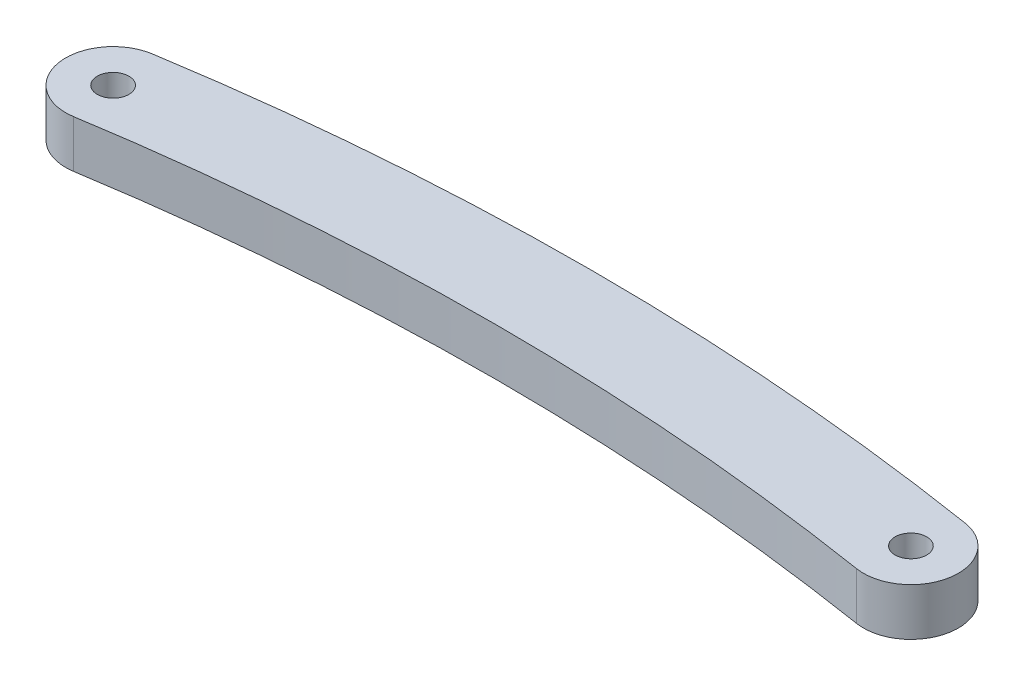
ISO-10303-21;
HEADER;
FILE_DESCRIPTION(('STEP AP214'),'2;1');
FILE_NAME('part.step','',(''),(''),'','','');
FILE_SCHEMA(('AUTOMOTIVE_DESIGN { 1 0 10303 214 1 1 1 1 }'));
ENDSEC;
DATA;
#1=APPLICATION_CONTEXT('core data for automotive mechanical design processes');
#2=APPLICATION_PROTOCOL_DEFINITION('international standard','automotive_design',2000,#1);
#3=PRODUCT_CONTEXT('',#1,'mechanical');
#4=PRODUCT('Part','Part','',(#3));
#5=PRODUCT_RELATED_PRODUCT_CATEGORY('part','',(#4));
#6=PRODUCT_DEFINITION_FORMATION('','',#4);
#7=PRODUCT_DEFINITION_CONTEXT('part definition',#1,'design');
#8=PRODUCT_DEFINITION('design','',#6,#7);
#9=PRODUCT_DEFINITION_SHAPE('','',#8);
#10=(LENGTH_UNIT() NAMED_UNIT(*) SI_UNIT(.MILLI.,.METRE.));
#11=(NAMED_UNIT(*) PLANE_ANGLE_UNIT() SI_UNIT($,.RADIAN.));
#12=(NAMED_UNIT(*) SI_UNIT($,.STERADIAN.) SOLID_ANGLE_UNIT());
#13=UNCERTAINTY_MEASURE_WITH_UNIT(LENGTH_MEASURE(1.E-05),#10,'distance_accuracy_value','');
#14=(GEOMETRIC_REPRESENTATION_CONTEXT(3) GLOBAL_UNCERTAINTY_ASSIGNED_CONTEXT((#13)) GLOBAL_UNIT_ASSIGNED_CONTEXT((#10,
#11,#12)) REPRESENTATION_CONTEXT('',''));
#15=CARTESIAN_POINT('',(0.,0.,0.));
#16=DIRECTION('',(0.,0.,1.));
#17=DIRECTION('',(1.,0.,0.));
#18=AXIS2_PLACEMENT_3D('',#15,#16,#17);
#19=CARTESIAN_POINT('',(12.61044108,3.,79.0116121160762));
#20=DIRECTION('',(0.,1.,0.));
#21=DIRECTION('',(0.,0.,1.));
#22=AXIS2_PLACEMENT_3D('',#19,#20,#21);
#23=PLANE('',#22);
#24=CARTESIAN_POINT('',(25.22088216,3.,0.));
#25=DIRECTION('',(0.,1.,0.));
#26=DIRECTION('',(0.,0.,1.));
#27=AXIS2_PLACEMENT_3D('',#24,#25,#26);
#28=CIRCLE('',#27,1.);
#29=CARTESIAN_POINT('',(25.22088216,3.,1.));
#30=VERTEX_POINT('',#29);
#31=EDGE_CURVE('E99',#30,#30,#28,.T.);
#32=ORIENTED_EDGE('',*,*,#31,.F.);
#33=EDGE_LOOP('',(#32));
#34=FACE_BOUND('',#33,.T.);
#35=CARTESIAN_POINT('',(25.22088216,3.,0.));
#36=DIRECTION('',(0.,1.,0.));
#37=DIRECTION('',(0.,0.,1.));
#38=AXIS2_PLACEMENT_3D('',#35,#36,#37);
#39=CIRCLE('',#38,3.);
#40=CARTESIAN_POINT('',(24.7480592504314,3.,2.96250544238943));
#41=VERTEX_POINT('',#40);
#42=CARTESIAN_POINT('',(25.6937050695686,3.,-2.96250544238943));
#43=VERTEX_POINT('',#42);
#44=EDGE_CURVE('E84',#41,#43,#39,.T.);
#45=ORIENTED_EDGE('',*,*,#44,.T.);
#46=CARTESIAN_POINT('',(0.,3.,158.023224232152));
#47=DIRECTION('',(0.,1.,0.));
#48=DIRECTION('',(0.,0.,1.));
#49=AXIS2_PLACEMENT_3D('',#46,#47,#48);
#50=CIRCLE('',#49,163.023224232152);
#51=CARTESIAN_POINT('',(-25.6937050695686,3.,-2.96250544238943));
#52=VERTEX_POINT('',#51);
#53=EDGE_CURVE('E79',#43,#52,#50,.T.);
#54=ORIENTED_EDGE('',*,*,#53,.T.);
#55=CARTESIAN_POINT('',(-25.22088216,3.,0.));
#56=DIRECTION('',(0.,1.,0.));
#57=DIRECTION('',(0.,0.,1.));
#58=AXIS2_PLACEMENT_3D('',#55,#56,#57);
#59=CIRCLE('',#58,3.);
#60=CARTESIAN_POINT('',(-24.7480592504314,3.,2.96250544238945));
#61=VERTEX_POINT('',#60);
#62=EDGE_CURVE('E82',#52,#61,#59,.T.);
#63=ORIENTED_EDGE('',*,*,#62,.T.);
#64=CARTESIAN_POINT('',(0.,3.,158.023224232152));
#65=DIRECTION('',(0.,-1.,0.));
#66=DIRECTION('',(0.,0.,1.));
#67=AXIS2_PLACEMENT_3D('',#64,#65,#66);
#68=CIRCLE('',#67,157.023224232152);
#69=EDGE_CURVE('E49',#61,#41,#68,.T.);
#70=ORIENTED_EDGE('',*,*,#69,.T.);
#71=EDGE_LOOP('',(#45,#54,#63,#70));
#72=FACE_BOUND('',#71,.T.);
#73=CARTESIAN_POINT('',(-25.22088216,3.,0.));
#74=DIRECTION('',(0.,1.,0.));
#75=DIRECTION('',(0.,0.,1.));
#76=AXIS2_PLACEMENT_3D('',#73,#74,#75);
#77=CIRCLE('',#76,1.);
#78=CARTESIAN_POINT('',(-25.22088216,3.,1.00000000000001));
#79=VERTEX_POINT('',#78);
#80=EDGE_CURVE('E114',#79,#79,#77,.T.);
#81=ORIENTED_EDGE('',*,*,#80,.F.);
#82=EDGE_LOOP('',(#81));
#83=FACE_BOUND('',#82,.T.);
#84=ADVANCED_FACE('F32',(#34,#72,#83),#23,.T.);
#85=CARTESIAN_POINT('',(12.61044108,0.,79.0116121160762));
#86=DIRECTION('',(0.,1.,0.));
#87=DIRECTION('',(0.,0.,1.));
#88=AXIS2_PLACEMENT_3D('',#85,#86,#87);
#89=PLANE('',#88);
#90=CARTESIAN_POINT('',(25.22088216,0.,0.));
#91=DIRECTION('',(0.,1.,0.));
#92=DIRECTION('',(0.,0.,1.));
#93=AXIS2_PLACEMENT_3D('',#90,#91,#92);
#94=CIRCLE('',#93,1.);
#95=CARTESIAN_POINT('',(25.22088216,0.,1.));
#96=VERTEX_POINT('',#95);
#97=EDGE_CURVE('E111',#96,#96,#94,.T.);
#98=ORIENTED_EDGE('',*,*,#97,.T.);
#99=EDGE_LOOP('',(#98));
#100=FACE_BOUND('',#99,.T.);
#101=CARTESIAN_POINT('',(25.22088216,0.,0.));
#102=DIRECTION('',(0.,1.,0.));
#103=DIRECTION('',(0.,0.,1.));
#104=AXIS2_PLACEMENT_3D('',#101,#102,#103);
#105=CIRCLE('',#104,3.);
#106=CARTESIAN_POINT('',(24.7480592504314,0.,2.96250544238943));
#107=VERTEX_POINT('',#106);
#108=CARTESIAN_POINT('',(25.6937050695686,0.,-2.96250544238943));
#109=VERTEX_POINT('',#108);
#110=EDGE_CURVE('E96',#107,#109,#105,.T.);
#111=ORIENTED_EDGE('',*,*,#110,.F.);
#112=CARTESIAN_POINT('',(0.,0.,158.023224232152));
#113=DIRECTION('',(0.,-1.,0.));
#114=DIRECTION('',(0.,0.,1.));
#115=AXIS2_PLACEMENT_3D('',#112,#113,#114);
#116=CIRCLE('',#115,157.023224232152);
#117=CARTESIAN_POINT('',(-24.7480592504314,0.,2.96250544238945));
#118=VERTEX_POINT('',#117);
#119=EDGE_CURVE('E72',#118,#107,#116,.T.);
#120=ORIENTED_EDGE('',*,*,#119,.F.);
#121=CARTESIAN_POINT('',(-25.22088216,0.,0.));
#122=DIRECTION('',(0.,1.,0.));
#123=DIRECTION('',(0.,0.,1.));
#124=AXIS2_PLACEMENT_3D('',#121,#122,#123);
#125=CIRCLE('',#124,3.);
#126=CARTESIAN_POINT('',(-25.6937050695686,0.,-2.96250544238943));
#127=VERTEX_POINT('',#126);
#128=EDGE_CURVE('E66',#127,#118,#125,.T.);
#129=ORIENTED_EDGE('',*,*,#128,.F.);
#130=CARTESIAN_POINT('',(0.,0.,158.023224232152));
#131=DIRECTION('',(0.,1.,0.));
#132=DIRECTION('',(0.,0.,1.));
#133=AXIS2_PLACEMENT_3D('',#130,#131,#132);
#134=CIRCLE('',#133,163.023224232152);
#135=EDGE_CURVE('E88',#109,#127,#134,.T.);
#136=ORIENTED_EDGE('',*,*,#135,.F.);
#137=EDGE_LOOP('',(#111,#120,#129,#136));
#138=FACE_BOUND('',#137,.T.);
#139=CARTESIAN_POINT('',(-25.22088216,0.,0.));
#140=DIRECTION('',(0.,1.,0.));
#141=DIRECTION('',(0.,0.,1.));
#142=AXIS2_PLACEMENT_3D('',#139,#140,#141);
#143=CIRCLE('',#142,1.);
#144=CARTESIAN_POINT('',(-25.22088216,0.,1.00000000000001));
#145=VERTEX_POINT('',#144);
#146=EDGE_CURVE('E117',#145,#145,#143,.T.);
#147=ORIENTED_EDGE('',*,*,#146,.T.);
#148=EDGE_LOOP('',(#147));
#149=FACE_BOUND('',#148,.T.);
#150=ADVANCED_FACE('F107',(#100,#138,#149),#89,.F.);
#151=CARTESIAN_POINT('',(25.22088216,3.,0.));
#152=DIRECTION('',(0.,-1.,0.));
#153=DIRECTION('',(0.,0.,-1.));
#154=AXIS2_PLACEMENT_3D('',#151,#152,#153);
#155=CYLINDRICAL_SURFACE('',#154,3.);
#156=ORIENTED_EDGE('',*,*,#110,.T.);
#157=DIRECTION('',(0.,-1.,0.));
#158=VECTOR('',#157,1.);
#159=CARTESIAN_POINT('',(25.6937050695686,3.,-2.96250544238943));
#160=LINE('',#159,#158);
#161=EDGE_CURVE('E11',#43,#109,#160,.T.);
#162=ORIENTED_EDGE('',*,*,#161,.F.);
#163=ORIENTED_EDGE('',*,*,#44,.F.);
#164=DIRECTION('',(0.,-1.,0.));
#165=VECTOR('',#164,1.);
#166=CARTESIAN_POINT('',(24.7480592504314,3.,2.96250544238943));
#167=LINE('',#166,#165);
#168=EDGE_CURVE('E92',#41,#107,#167,.T.);
#169=ORIENTED_EDGE('',*,*,#168,.T.);
#170=EDGE_LOOP('',(#156,#162,#163,#169));
#171=FACE_BOUND('',#170,.T.);
#172=ADVANCED_FACE('F34',(#171),#155,.T.);
#173=CARTESIAN_POINT('',(0.,3.,158.023224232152));
#174=DIRECTION('',(0.,-1.,0.));
#175=DIRECTION('',(0.,0.,-1.));
#176=AXIS2_PLACEMENT_3D('',#173,#174,#175);
#177=CYLINDRICAL_SURFACE('',#176,163.023224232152);
#178=ORIENTED_EDGE('',*,*,#135,.T.);
#179=DIRECTION('',(0.,-1.,0.));
#180=VECTOR('',#179,1.);
#181=CARTESIAN_POINT('',(-25.6937050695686,3.,-2.96250544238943));
#182=LINE('',#181,#180);
#183=EDGE_CURVE('E41',#52,#127,#182,.T.);
#184=ORIENTED_EDGE('',*,*,#183,.F.);
#185=ORIENTED_EDGE('',*,*,#53,.F.);
#186=ORIENTED_EDGE('',*,*,#161,.T.);
#187=EDGE_LOOP('',(#178,#184,#185,#186));
#188=FACE_BOUND('',#187,.T.);
#189=ADVANCED_FACE('F87',(#188),#177,.T.);
#190=CARTESIAN_POINT('',(-25.22088216,3.,0.));
#191=DIRECTION('',(0.,-1.,0.));
#192=DIRECTION('',(0.,0.,-1.));
#193=AXIS2_PLACEMENT_3D('',#190,#191,#192);
#194=CYLINDRICAL_SURFACE('',#193,3.);
#195=ORIENTED_EDGE('',*,*,#128,.T.);
#196=DIRECTION('',(0.,-1.,0.));
#197=VECTOR('',#196,1.);
#198=CARTESIAN_POINT('',(-24.7480592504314,3.,2.96250544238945));
#199=LINE('',#198,#197);
#200=EDGE_CURVE('E89',#61,#118,#199,.T.);
#201=ORIENTED_EDGE('',*,*,#200,.F.);
#202=ORIENTED_EDGE('',*,*,#62,.F.);
#203=ORIENTED_EDGE('',*,*,#183,.T.);
#204=EDGE_LOOP('',(#195,#201,#202,#203));
#205=FACE_BOUND('',#204,.T.);
#206=ADVANCED_FACE('F90',(#205),#194,.T.);
#207=CARTESIAN_POINT('',(0.,3.,158.023224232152));
#208=DIRECTION('',(0.,-1.,0.));
#209=DIRECTION('',(0.,0.,-1.));
#210=AXIS2_PLACEMENT_3D('',#207,#208,#209);
#211=CYLINDRICAL_SURFACE('',#210,157.023224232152);
#212=ORIENTED_EDGE('',*,*,#119,.T.);
#213=ORIENTED_EDGE('',*,*,#168,.F.);
#214=ORIENTED_EDGE('',*,*,#69,.F.);
#215=ORIENTED_EDGE('',*,*,#200,.T.);
#216=EDGE_LOOP('',(#212,#213,#214,#215));
#217=FACE_BOUND('',#216,.T.);
#218=ADVANCED_FACE('F104',(#217),#211,.F.);
#219=CARTESIAN_POINT('',(25.22088216,3.,0.));
#220=DIRECTION('',(0.,-1.,0.));
#221=DIRECTION('',(0.,0.,-1.));
#222=AXIS2_PLACEMENT_3D('',#219,#220,#221);
#223=CYLINDRICAL_SURFACE('',#222,1.);
#224=ORIENTED_EDGE('',*,*,#31,.T.);
#225=EDGE_LOOP('',(#224));
#226=FACE_BOUND('',#225,.T.);
#227=ORIENTED_EDGE('',*,*,#97,.F.);
#228=EDGE_LOOP('',(#227));
#229=FACE_BOUND('',#228,.T.);
#230=ADVANCED_FACE('F135',(#226,#229),#223,.F.);
#231=CARTESIAN_POINT('',(-25.22088216,3.,0.));
#232=DIRECTION('',(0.,-1.,0.));
#233=DIRECTION('',(0.,0.,-1.));
#234=AXIS2_PLACEMENT_3D('',#231,#232,#233);
#235=CYLINDRICAL_SURFACE('',#234,1.);
#236=ORIENTED_EDGE('',*,*,#80,.T.);
#237=EDGE_LOOP('',(#236));
#238=FACE_BOUND('',#237,.T.);
#239=ORIENTED_EDGE('',*,*,#146,.F.);
#240=EDGE_LOOP('',(#239));
#241=FACE_BOUND('',#240,.T.);
#242=ADVANCED_FACE('F123',(#238,#241),#235,.F.);
#243=CLOSED_SHELL('',(#84,#150,#172,#189,#206,#218,#230,#242));
#244=MANIFOLD_SOLID_BREP('B2',#243);
#245=ADVANCED_BREP_SHAPE_REPRESENTATION('',(#18,#244),#14);
#246=SHAPE_DEFINITION_REPRESENTATION(#9,#245);
ENDSEC;
END-ISO-10303-21;
